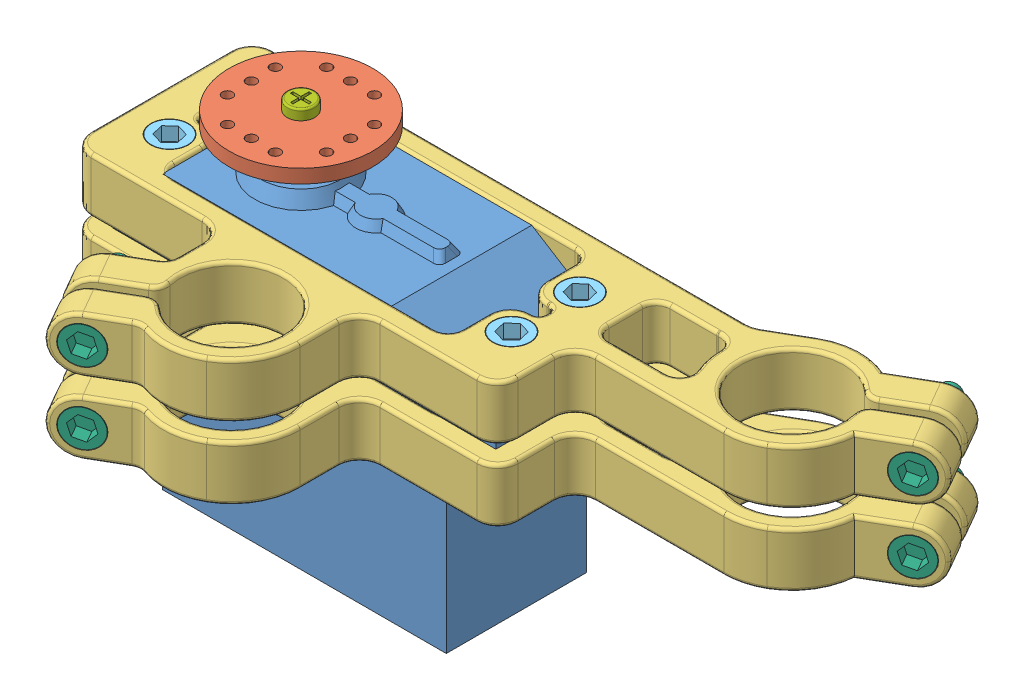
SolidWorks assembly Servo-Asm-F.SLDASM, configuration Default (file format 7000). Lengths in mm.
Overall size (115.17 49.5 98.53).
21 component instances, 7 part files, 42 mates.
Components (placement in the parent):
- Servo SM-S4303R-1: Servo SM-S4303R.SLDPRT [Default] at origin size (56 46 20.51)
- Servo SM-S4303R - SmallWheel1-1: Servo SM-S4303R - SmallWheel1.SLDPRT [Default] at (0 8 0) size (21 5.7 21)
- Servo Mount-1: Servo Mount.SLDPRT [Default] at (37.5 -8 6.6395) x (0 1 0) z (-0.866025 0 0.5) size (8 55.49 100.95)
- Servo Mount-3: Servo Mount.SLDPRT [Default] at (37.5 -18.5 6.6395) x (0 1 0) z (-0.866025 0 0.5) size (8 55.49 100.95)
- M3 Nut-1: M3 Nut.SLDPRT [Default] at (35.5 -18.5 -5.2887) size (5.5 2.3 6.35)
- M3 Nut-2: M3 Nut.SLDPRT [Default] at (35.5 -18.5 4.7113) size (5.5 2.3 6.35)
- M3 Nut-3: M3 Nut.SLDPRT [Default] at (-14.5 -18.5 -5.2887) size (5.5 2.3 6.35)
- M3 Nut-4: M3 Nut.SLDPRT [Default] at (-14.5 -18.5 4.7113) size (5.5 2.3 6.35)
- M3x16-1: M3x16.SLDPRT [Default] at (35.5 -3 4.7113) x (-0.837169 0 -0.546944) z (-0.546944 0 0.837169) size (5.35 19 5.35)
- M3x16-2: M3x16.SLDPRT [Default] at (-14.5 -3 4.7113) x (-0.837169 0 -0.546944) z (-0.546944 0 0.837169) size (5.35 19 5.35)
- M3x16-3: M3x16.SLDPRT [Default] at (-14.5 -3 -5.2887) x (-0.837169 0 -0.546944) z (-0.546944 0 0.837169) size (5.35 19 5.35)
- M3x16-4: M3x16.SLDPRT [Default] at (35.5 -3 -5.2887) x (-0.837169 0 -0.546944) z (-0.546944 0 0.837169) size (5.35 19 5.35)
- M3 Nut-5: M3 Nut.SLDPRT [Default] at (-3.8806 -14.5 23.8911) x (0.75 -0.5 -0.433013) z (-0.433013 -0.866025 0.25) size (5.5 2.3 6.35)
- M3 Nut-6: M3 Nut.SLDPRT [Default] at (-3.8806 -4 23.8911) x (0.75 -0.5 -0.433013) z (-0.433013 -0.866025 0.25) size (5.5 2.3 6.35)
- M3 Nut-7: M3 Nut.SLDPRT [Default] at (73.1306 -14.5 -20.5713) x (0.75 -0.5 -0.433013) z (-0.433013 -0.866025 0.25) size (5.5 2.3 6.35)
- M3 Nut-8: M3 Nut.SLDPRT [Default] at (73.1306 -4 -20.5713) x (0.75 -0.5 -0.433013) z (-0.433013 -0.866025 0.25) size (5.5 2.3 6.35)
- M3x12-1: M3x12.SLDPRT [Default] at (0.3694 -4 31.2523) x (0.75 0.5 -0.433013) z (-0.433013 0.866025 0.25) size (5.35 15 5.35)
- M3x12-2: M3x12.SLDPRT [Default] at (0.3694 -14.5 31.2523) x (0.75 0.5 -0.433013) z (-0.433013 0.866025 0.25) size (5.35 15 5.35)
- M3x12-3: M3x12.SLDPRT [Default] at (77.3806 -14.5 -13.2101) x (0.75 0.5 -0.433013) z (-0.433013 0.866025 0.25) size (5.35 15 5.35)
- M3x12-4: M3x12.SLDPRT [Default] at (77.3806 -4 -13.2101) x (0.75 0.5 -0.433013) z (-0.433013 0.866025 0.25) size (5.35 15 5.35)
- Servo Screw-1: Servo Screw.SLDPRT [Default] at (0 5 0) size (4 4.5 4)
Mates (geometry in assembly coordinates):
- Coincident1: coincident anti-aligned: plane of Servo SM-S4303R-1 through (0 6 0) normal (0 1 0); plane of Servo SM-S4303R - SmallWheel1-1 through (0 6 0) normal (0 -1 0)
- Concentric2: concentric anti-aligned: cylinder of Servo SM-S4303R-1 through (0 6 0) axis (0 -1 0) radius 3; cylinder of Servo SM-S4303R - SmallWheel1-1 through (0 2.3 0) axis (0 1 0) radius 3
- Coincident4: coincident: line of Servo SM-S4303R-1 through (31.5 -8 10.2561) axis (1 0 0); plane of Servo Mount-1 through (37.5 -8 6.6395) normal (0 -1 0)
- Coincident5: coincident anti-aligned: plane of Servo SM-S4303R-1 through (31.5 -40 -10.25) normal (1 0 0); plane of Servo Mount-1 through (31.5 0 9.9613) normal (-1 0 0)
- Lock1: lock: unknown of Servo SM-S4303R-1; unknown of Servo Mount-1
- Concentric4: concentric aligned: cylinder of Servo Mount-1 through (63.4808 0 -8.3605) axis (0 -1 0) radius 7.5; cylinder of Servo Mount-3 through (63.4808 -10.5 -8.3605) axis (0 -1 0) radius 7.5
- Concentric5: concentric aligned: cylinder of Servo Mount-1 through (11.5192 0 21.6395) axis (0 -1 0) radius 7.5; cylinder of Servo Mount-3 through (11.5192 -10.5 21.6395) axis (0 -1 0) radius 7.5
- Coincident6: coincident anti-aligned: plane of Servo SM-S4303R-1 through (0 -10.5 0) normal (0 -1 0); plane of Servo Mount-3 through (37.5 -10.5 6.6395) normal (0 1 0)
- Coincident7: coincident aligned: plane of M3x16-3 through (-14.5 -3 -5.2887) normal (0 -1 0); plane of M3x16-4 through (35.5 -3 -5.2887) normal (0 -1 0)
- Coincident8: coincident aligned: plane of M3x16-2 through (-14.5 -3 4.7113) normal (0 -1 0); plane of M3x16-3 through (-14.5 -3 -5.2887) normal (0 -1 0)
- Coincident9: coincident aligned: plane of M3x16-1 through (35.5 -3 4.7113) normal (0 -1 0); plane of M3x16-2 through (-14.5 -3 4.7113) normal (0 -1 0)
- Coincident10: coincident anti-aligned: circle of Servo Mount-1; plane of M3x16-4 through (35.5 -3 -5.2887) normal (0 -1 0)
- Concentric6: concentric anti-aligned: cylinder of Servo Mount-1 through (35.5 -3 -5.2887) axis (0 1 0) radius 2.75; cylinder of M3x16-4 through (35.5 0 -5.2887) axis (0 -1 0) radius 2.675
- Concentric7: concentric anti-aligned: cylinder of Servo Mount-1 through (-14.5 -3 -5.2887) axis (0 1 0) radius 2.75; cylinder of M3x16-3 through (-14.5 0 -5.2887) axis (0 -1 0) radius 2.675
- Concentric8: concentric anti-aligned: cylinder of Servo Mount-1 through (-14.5 -3 4.7113) axis (0 1 0) radius 2.75; cylinder of M3x16-2 through (-14.5 0 4.7113) axis (0 -1 0) radius 2.675
- Concentric9: concentric anti-aligned: cylinder of Servo Mount-1 through (35.5 -3 4.7113) axis (0 1 0) radius 2.75; cylinder of M3x16-1 through (35.5 0 4.7113) axis (0 -1 0) radius 2.675
- Coincident11: coincident aligned: plane of M3 Nut-1 through (35.5 -18.5 -5.2887) normal (0 -1 0); plane of M3 Nut-3 through (-14.5 -18.5 -5.2887) normal (0 -1 0)
- Coincident12: coincident aligned: plane of M3 Nut-2 through (35.5 -18.5 4.7113) normal (0 -1 0); plane of M3 Nut-3 through (-14.5 -18.5 -5.2887) normal (0 -1 0)
- Coincident13: coincident aligned: plane of M3 Nut-2 through (35.5 -18.5 4.7113) normal (0 -1 0); plane of M3 Nut-4 through (-14.5 -18.5 4.7113) normal (0 -1 0)
- Coincident14: coincident aligned: plane of Servo Mount-3 through (37.5 -18.5 6.6395) normal (0 -1 0); plane of M3 Nut-1 through (35.5 -18.5 -5.2887) normal (0 -1 0)
- Concentric10: concentric anti-aligned: circle of M3 Nut-1; circle of M3x16-4
- Concentric11: concentric anti-aligned: circle of M3 Nut-3; circle of M3x16-3
- Concentric12: concentric anti-aligned: circle of M3 Nut-2; circle of M3x16-1
- Concentric13: concentric anti-aligned: circle of M3 Nut-4; circle of M3x16-2
- Coincident16: coincident aligned: plane of M3x12-3 through (78.8806 -14.5 -10.612) normal (0.5 0 0.866025); plane of M3x12-4 through (78.8806 -4 -10.612) normal (0.5 0 0.866025)
- Coincident17: coincident aligned: plane of Servo Mount-1 through (40.375 -8 11.6192) normal (0.5 0 0.866025); plane of M3x12-3 through (78.8806 -14.5 -10.612) normal (0.5 0 0.866025)
- Concentric14: concentric anti-aligned: cylinder of Servo Mount-1 through (77.3806 -4 -13.2101) axis (0.5 0 0.866025) radius 2.75; cylinder of M3x12-4 through (78.8806 -4 -10.612) axis (-0.5 0 -0.866025) radius 2.675
- Concentric15: concentric anti-aligned: cylinder of Servo Mount-3 through (77.3806 -14.5 -13.2101) axis (0.5 0 0.866025) radius 2.75; cylinder of M3x12-3 through (78.8806 -14.5 -10.612) axis (-0.5 0 -0.866025) radius 2.675
- Coincident18: coincident anti-aligned: plane of M3 Nut-7 through (73.1306 -14.5 -20.5713) normal (-0.5 0 -0.866025); circle of M3 Nut-8
- Coincident19: coincident aligned: plane of Servo Mount-3 through (34.625 -18.5 1.6599) normal (-0.5 0 -0.866025); plane of M3 Nut-7 through (73.1306 -14.5 -20.5713) normal (-0.5 0 -0.866025)
- Concentric16: concentric anti-aligned: circle of M3 Nut-7; circle of M3x12-3
- Concentric17: concentric anti-aligned: circle of M3 Nut-8; circle of M3x12-4
- Coincident21: coincident aligned: circle of M3x12-1; plane of M3x12-2 through (1.8694 -14.5 33.8504) normal (0.5 0 0.866025)
- Coincident22: coincident aligned: plane of Servo Mount-3 through (40.375 -18.5 11.6192) normal (0.5 0 0.866025); plane of M3x12-2 through (1.8694 -14.5 33.8504) normal (0.5 0 0.866025)
- Concentric18: concentric anti-aligned: cylinder of Servo Mount-3 through (0.3694 -14.5 31.2523) axis (0.5 0 0.866025) radius 2.75; cylinder of M3x12-2 through (1.8694 -14.5 33.8504) axis (-0.5 0 -0.866025) radius 2.675
- Concentric19: concentric anti-aligned: cylinder of Servo Mount-1 through (0.3694 -4 31.2523) axis (0.5 0 0.866025) radius 2.75; cylinder of M3x12-1 through (1.8694 -4 33.8504) axis (-0.5 0 -0.866025) radius 2.675
- Coincident23: coincident aligned: plane of M3 Nut-5 through (-3.8806 -14.5 23.8911) normal (-0.5 0 -0.866025); plane of M3 Nut-6 through (-3.8806 -4 23.8911) normal (-0.5 0 -0.866025)
- Coincident24: coincident aligned: plane of Servo Mount-3 through (34.625 -18.5 1.6599) normal (-0.5 0 -0.866025); plane of M3 Nut-6 through (-3.8806 -4 23.8911) normal (-0.5 0 -0.866025)
- Concentric20: concentric anti-aligned: circle of M3 Nut-5; circle of M3x12-2
- Concentric21: concentric anti-aligned: circle of M3 Nut-6; circle of M3x12-1
- Concentric22: concentric anti-aligned: cylinder of Servo SM-S4303R - SmallWheel1-1 through (0 6 0) axis (0 1 0) radius 1.5; cylinder of Servo Screw-1 through (0 8 0) axis (0 -1 0) radius 1
- Coincident25: coincident anti-aligned: plane of Servo SM-S4303R - SmallWheel1-1 through (0 8 0) normal (0 1 0); plane of Servo Screw-1 through (0 8 0) normal (0 -1 0)
